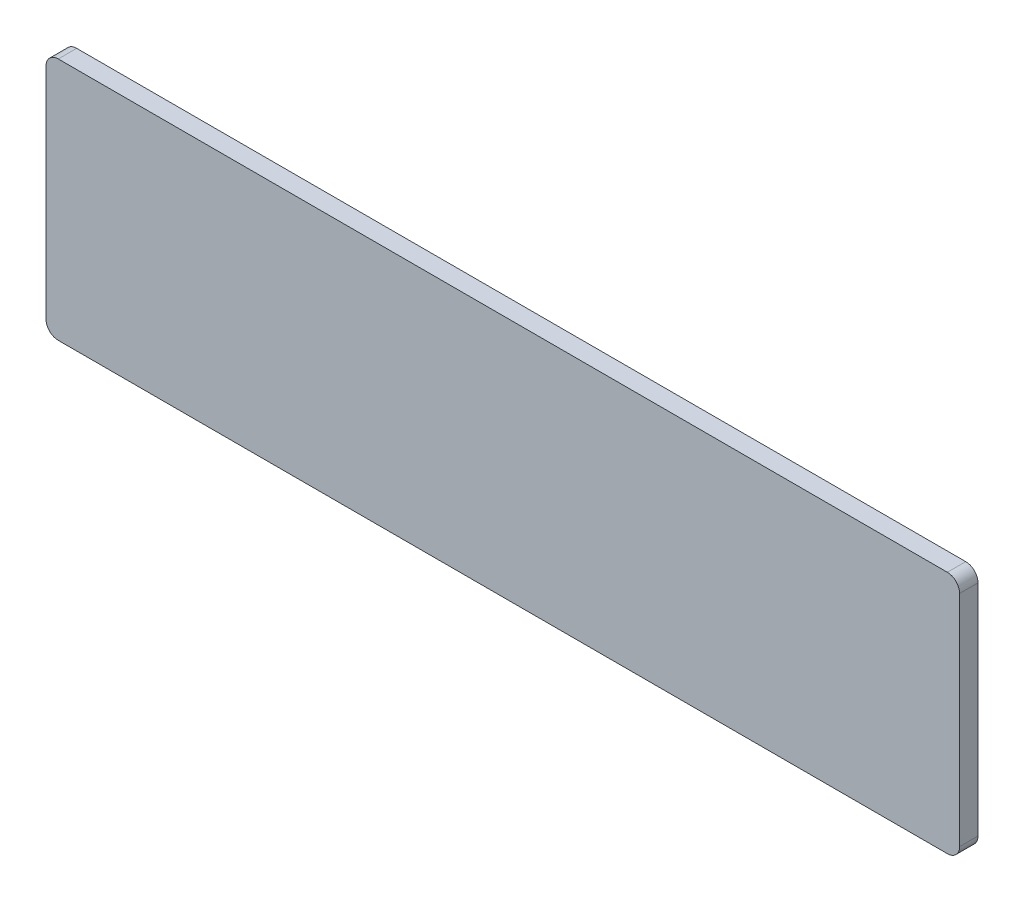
from build123d import *

# Parameters (mm, degrees)
SKETCH1_W           = 149
SKETCH1_H           = 39.75
BOSS_EXTRUDE1_DEPTH = 3
FILLET1_R           = 2


with BuildPart() as part:
    # Sketch1 → Boss-Extrude1 (new body)
    with BuildSketch(Plane.XY):
        Rectangle(SKETCH1_W, SKETCH1_H)
    extrude(amount=BOSS_EXTRUDE1_DEPTH)

    # Fillet1
    fillet1_edges = [part.edges().sort_by_distance(p)[0] for p in [
        (-74.5, 19.875, 1.5),
        (74.5, 19.875, 1.5),
        (74.5, -19.875, 1.5),
        (-74.5, -19.875, 1.5),
    ]]
    fillet(fillet1_edges, radius=FILLET1_R)


solid = part.part
